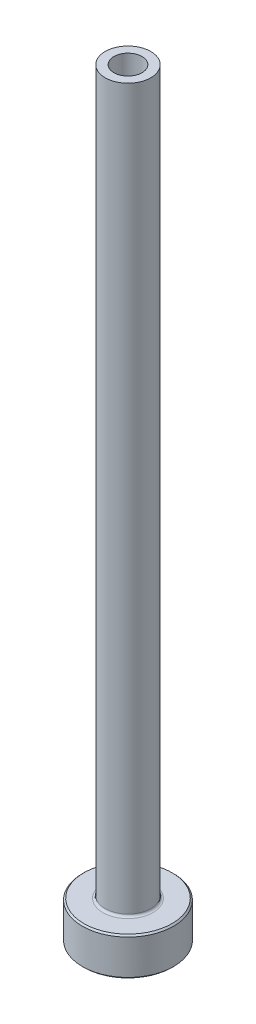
ISO-10303-21;
HEADER;
FILE_DESCRIPTION(('STEP AP214'),'2;1');
FILE_NAME('part.step','',(''),(''),'','','');
FILE_SCHEMA(('AUTOMOTIVE_DESIGN { 1 0 10303 214 1 1 1 1 }'));
ENDSEC;
DATA;
#1=APPLICATION_CONTEXT('core data for automotive mechanical design processes');
#2=APPLICATION_PROTOCOL_DEFINITION('international standard','automotive_design',2000,#1);
#3=PRODUCT_CONTEXT('',#1,'mechanical');
#4=PRODUCT('Part','Part','',(#3));
#5=PRODUCT_RELATED_PRODUCT_CATEGORY('part','',(#4));
#6=PRODUCT_DEFINITION_FORMATION('','',#4);
#7=PRODUCT_DEFINITION_CONTEXT('part definition',#1,'design');
#8=PRODUCT_DEFINITION('design','',#6,#7);
#9=PRODUCT_DEFINITION_SHAPE('','',#8);
#10=(LENGTH_UNIT() NAMED_UNIT(*) SI_UNIT(.MILLI.,.METRE.));
#11=(NAMED_UNIT(*) PLANE_ANGLE_UNIT() SI_UNIT($,.RADIAN.));
#12=(NAMED_UNIT(*) SI_UNIT($,.STERADIAN.) SOLID_ANGLE_UNIT());
#13=UNCERTAINTY_MEASURE_WITH_UNIT(LENGTH_MEASURE(1.E-05),#10,'distance_accuracy_value','');
#14=(GEOMETRIC_REPRESENTATION_CONTEXT(3) GLOBAL_UNCERTAINTY_ASSIGNED_CONTEXT((#13)) GLOBAL_UNIT_ASSIGNED_CONTEXT((#10,
#11,#12)) REPRESENTATION_CONTEXT('',''));
#15=CARTESIAN_POINT('',(0.,0.,0.));
#16=DIRECTION('',(0.,0.,1.));
#17=DIRECTION('',(1.,0.,0.));
#18=AXIS2_PLACEMENT_3D('',#15,#16,#17);
#19=CARTESIAN_POINT('',(0.,92.1876809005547,0.));
#20=DIRECTION('',(0.,1.,0.));
#21=DIRECTION('',(0.,0.,1.));
#22=AXIS2_PLACEMENT_3D('',#19,#20,#21);
#23=CYLINDRICAL_SURFACE('',#22,1.84999999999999);
#24=CARTESIAN_POINT('',(0.,100.,0.));
#25=DIRECTION('',(0.,1.,0.));
#26=DIRECTION('',(0.,0.,1.));
#27=AXIS2_PLACEMENT_3D('',#24,#25,#26);
#28=CIRCLE('',#27,1.84999999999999);
#29=CARTESIAN_POINT('',(0.,100.,1.84999999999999));
#30=VERTEX_POINT('',#29);
#31=EDGE_CURVE('E62',#30,#30,#28,.T.);
#32=ORIENTED_EDGE('',*,*,#31,.T.);
#33=EDGE_LOOP('',(#32));
#34=FACE_BOUND('',#33,.T.);
#35=CARTESIAN_POINT('',(0.,55.,0.));
#36=DIRECTION('',(0.,1.,0.));
#37=DIRECTION('',(0.,0.,1.));
#38=AXIS2_PLACEMENT_3D('',#35,#36,#37);
#39=CIRCLE('',#38,1.84999999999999);
#40=CARTESIAN_POINT('',(0.,55.,1.84999999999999));
#41=VERTEX_POINT('',#40);
#42=EDGE_CURVE('E71',#41,#41,#39,.T.);
#43=ORIENTED_EDGE('',*,*,#42,.F.);
#44=EDGE_LOOP('',(#43));
#45=FACE_BOUND('',#44,.T.);
#46=ADVANCED_FACE('F30',(#34,#45),#23,.F.);
#47=CARTESIAN_POINT('',(-1.84999999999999,100.,0.));
#48=DIRECTION('',(0.,1.,0.));
#49=DIRECTION('',(0.,0.,1.));
#50=AXIS2_PLACEMENT_3D('',#47,#48,#49);
#51=PLANE('',#50);
#52=CARTESIAN_POINT('',(0.,100.,0.));
#53=DIRECTION('',(0.,1.,0.));
#54=DIRECTION('',(0.,0.,1.));
#55=AXIS2_PLACEMENT_3D('',#52,#53,#54);
#56=CIRCLE('',#55,3.);
#57=CARTESIAN_POINT('',(0.,100.,3.));
#58=VERTEX_POINT('',#57);
#59=EDGE_CURVE('E65',#58,#58,#56,.T.);
#60=ORIENTED_EDGE('',*,*,#59,.T.);
#61=EDGE_LOOP('',(#60));
#62=FACE_BOUND('',#61,.T.);
#63=ORIENTED_EDGE('',*,*,#31,.F.);
#64=EDGE_LOOP('',(#63));
#65=FACE_BOUND('',#64,.T.);
#66=ADVANCED_FACE('F79',(#62,#65),#51,.T.);
#67=CARTESIAN_POINT('',(0.,92.1876809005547,0.));
#68=DIRECTION('',(0.,1.,0.));
#69=DIRECTION('',(0.,0.,1.));
#70=AXIS2_PLACEMENT_3D('',#67,#68,#69);
#71=CYLINDRICAL_SURFACE('',#70,2.99999999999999);
#72=CARTESIAN_POINT('',(0.,5.3,0.));
#73=DIRECTION('',(0.,1.,0.));
#74=DIRECTION('',(0.,0.,1.));
#75=AXIS2_PLACEMENT_3D('',#72,#73,#74);
#76=CIRCLE('',#75,2.99999999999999);
#77=CARTESIAN_POINT('',(0.,5.3,2.99999999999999));
#78=VERTEX_POINT('',#77);
#79=EDGE_CURVE('E59',#78,#78,#76,.T.);
#80=ORIENTED_EDGE('',*,*,#79,.T.);
#81=EDGE_LOOP('',(#80));
#82=FACE_BOUND('',#81,.T.);
#83=ORIENTED_EDGE('',*,*,#59,.F.);
#84=EDGE_LOOP('',(#83));
#85=FACE_BOUND('',#84,.T.);
#86=ADVANCED_FACE('F85',(#82,#85),#71,.T.);
#87=CARTESIAN_POINT('',(-2.99999999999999,5.,0.));
#88=DIRECTION('',(0.,1.,0.));
#89=DIRECTION('',(0.,0.,1.));
#90=AXIS2_PLACEMENT_3D('',#87,#88,#89);
#91=PLANE('',#90);
#92=CARTESIAN_POINT('',(0.,5.,0.));
#93=DIRECTION('',(0.,1.,0.));
#94=DIRECTION('',(0.,0.,1.));
#95=AXIS2_PLACEMENT_3D('',#92,#93,#94);
#96=CIRCLE('',#95,5.79999999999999);
#97=CARTESIAN_POINT('',(0.,5.,5.79999999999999));
#98=VERTEX_POINT('',#97);
#99=EDGE_CURVE('E53',#98,#98,#96,.T.);
#100=ORIENTED_EDGE('',*,*,#99,.T.);
#101=EDGE_LOOP('',(#100));
#102=FACE_BOUND('',#101,.T.);
#103=CARTESIAN_POINT('',(0.,5.,0.));
#104=DIRECTION('',(0.,1.,0.));
#105=DIRECTION('',(0.,0.,1.));
#106=AXIS2_PLACEMENT_3D('',#103,#104,#105);
#107=CIRCLE('',#106,3.29999999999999);
#108=CARTESIAN_POINT('',(0.,5.,3.29999999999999));
#109=VERTEX_POINT('',#108);
#110=EDGE_CURVE('E56',#109,#109,#107,.F.);
#111=ORIENTED_EDGE('',*,*,#110,.T.);
#112=EDGE_LOOP('',(#111));
#113=FACE_BOUND('',#112,.T.);
#114=ADVANCED_FACE('F111',(#102,#113),#91,.T.);
#115=CARTESIAN_POINT('',(0.,92.1876809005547,0.));
#116=DIRECTION('',(0.,1.,0.));
#117=DIRECTION('',(0.,0.,1.));
#118=AXIS2_PLACEMENT_3D('',#115,#116,#117);
#119=CYLINDRICAL_SURFACE('',#118,5.99999999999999);
#120=CARTESIAN_POINT('',(0.,4.79999999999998,0.));
#121=DIRECTION('',(0.,1.,0.));
#122=DIRECTION('',(0.,0.,1.));
#123=AXIS2_PLACEMENT_3D('',#120,#121,#122);
#124=CIRCLE('',#123,5.99999999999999);
#125=CARTESIAN_POINT('',(0.,4.79999999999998,5.99999999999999));
#126=VERTEX_POINT('',#125);
#127=EDGE_CURVE('E45',#126,#126,#124,.F.);
#128=ORIENTED_EDGE('',*,*,#127,.T.);
#129=EDGE_LOOP('',(#128));
#130=FACE_BOUND('',#129,.T.);
#131=CARTESIAN_POINT('',(0.,0.200000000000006,0.));
#132=DIRECTION('',(0.,-1.,0.));
#133=DIRECTION('',(0.,0.,-1.));
#134=AXIS2_PLACEMENT_3D('',#131,#132,#133);
#135=CIRCLE('',#134,5.99999999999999);
#136=CARTESIAN_POINT('',(0.,0.200000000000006,-5.99999999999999));
#137=VERTEX_POINT('',#136);
#138=EDGE_CURVE('E50',#137,#137,#135,.F.);
#139=ORIENTED_EDGE('',*,*,#138,.T.);
#140=EDGE_LOOP('',(#139));
#141=FACE_BOUND('',#140,.T.);
#142=ADVANCED_FACE('F108',(#130,#141),#119,.T.);
#143=CARTESIAN_POINT('',(-5.99999999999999,0.,0.));
#144=DIRECTION('',(0.,-1.,0.));
#145=DIRECTION('',(0.,0.,-1.));
#146=AXIS2_PLACEMENT_3D('',#143,#144,#145);
#147=PLANE('',#146);
#148=CARTESIAN_POINT('',(0.,0.,0.));
#149=DIRECTION('',(0.,-1.,0.));
#150=DIRECTION('',(0.,0.,-1.));
#151=AXIS2_PLACEMENT_3D('',#148,#149,#150);
#152=CIRCLE('',#151,2.59999999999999);
#153=CARTESIAN_POINT('',(0.,0.,-2.59999999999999));
#154=VERTEX_POINT('',#153);
#155=EDGE_CURVE('E37',#154,#154,#152,.F.);
#156=ORIENTED_EDGE('',*,*,#155,.T.);
#157=EDGE_LOOP('',(#156));
#158=FACE_BOUND('',#157,.T.);
#159=CARTESIAN_POINT('',(0.,0.,0.));
#160=DIRECTION('',(0.,-1.,0.));
#161=DIRECTION('',(0.,0.,-1.));
#162=AXIS2_PLACEMENT_3D('',#159,#160,#161);
#163=CIRCLE('',#162,5.79999999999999);
#164=CARTESIAN_POINT('',(0.,0.,-5.79999999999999));
#165=VERTEX_POINT('',#164);
#166=EDGE_CURVE('E41',#165,#165,#163,.T.);
#167=ORIENTED_EDGE('',*,*,#166,.T.);
#168=EDGE_LOOP('',(#167));
#169=FACE_BOUND('',#168,.T.);
#170=ADVANCED_FACE('F110',(#158,#169),#147,.T.);
#171=CARTESIAN_POINT('',(0.,92.1876809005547,0.));
#172=DIRECTION('',(0.,1.,0.));
#173=DIRECTION('',(0.,0.,1.));
#174=AXIS2_PLACEMENT_3D('',#171,#172,#173);
#175=CYLINDRICAL_SURFACE('',#174,2.09999999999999);
#176=CARTESIAN_POINT('',(0.,0.499999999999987,0.));
#177=DIRECTION('',(0.,-1.,0.));
#178=DIRECTION('',(0.,0.,-1.));
#179=AXIS2_PLACEMENT_3D('',#176,#177,#178);
#180=CIRCLE('',#179,2.09999999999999);
#181=CARTESIAN_POINT('',(0.,0.499999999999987,-2.09999999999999));
#182=VERTEX_POINT('',#181);
#183=EDGE_CURVE('E10',#182,#182,#180,.T.);
#184=ORIENTED_EDGE('',*,*,#183,.T.);
#185=EDGE_LOOP('',(#184));
#186=FACE_BOUND('',#185,.T.);
#187=CARTESIAN_POINT('',(0.,43.,0.));
#188=DIRECTION('',(0.,1.,0.));
#189=DIRECTION('',(0.,0.,1.));
#190=AXIS2_PLACEMENT_3D('',#187,#188,#189);
#191=CIRCLE('',#190,2.1);
#192=CARTESIAN_POINT('',(0.,43.,2.1));
#193=VERTEX_POINT('',#192);
#194=EDGE_CURVE('E68',#193,#193,#191,.T.);
#195=ORIENTED_EDGE('',*,*,#194,.T.);
#196=EDGE_LOOP('',(#195));
#197=FACE_BOUND('',#196,.T.);
#198=ADVANCED_FACE('F118',(#186,#197),#175,.F.);
#199=CARTESIAN_POINT('',(0.,43.,0.));
#200=DIRECTION('',(0.,-1.,0.));
#201=DIRECTION('',(0.,0.,-1.));
#202=AXIS2_PLACEMENT_3D('',#199,#200,#201);
#203=CONICAL_SURFACE('',#202,2.1,0.0208303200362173);
#204=ORIENTED_EDGE('',*,*,#42,.T.);
#205=EDGE_LOOP('',(#204));
#206=FACE_BOUND('',#205,.T.);
#207=ORIENTED_EDGE('',*,*,#194,.F.);
#208=EDGE_LOOP('',(#207));
#209=FACE_BOUND('',#208,.T.);
#210=ADVANCED_FACE('F75',(#206,#209),#203,.F.);
#211=CARTESIAN_POINT('',(0.,5.3,0.));
#212=DIRECTION('',(0.,1.,0.));
#213=DIRECTION('',(0.,0.,1.));
#214=AXIS2_PLACEMENT_3D('',#211,#212,#213);
#215=TOROIDAL_SURFACE('',#214,3.29999999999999,0.3);
#216=ORIENTED_EDGE('',*,*,#110,.F.);
#217=EDGE_LOOP('',(#216));
#218=FACE_BOUND('',#217,.T.);
#219=ORIENTED_EDGE('',*,*,#79,.F.);
#220=EDGE_LOOP('',(#219));
#221=FACE_BOUND('',#220,.T.);
#222=ADVANCED_FACE('F90',(#218,#221),#215,.F.);
#223=CARTESIAN_POINT('',(0.,5.,0.));
#224=DIRECTION('',(0.,-1.,0.));
#225=DIRECTION('',(0.,0.,-1.));
#226=AXIS2_PLACEMENT_3D('',#223,#224,#225);
#227=CONICAL_SURFACE('',#226,5.79999999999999,0.785398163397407);
#228=ORIENTED_EDGE('',*,*,#127,.F.);
#229=EDGE_LOOP('',(#228));
#230=FACE_BOUND('',#229,.T.);
#231=ORIENTED_EDGE('',*,*,#99,.F.);
#232=EDGE_LOOP('',(#231));
#233=FACE_BOUND('',#232,.T.);
#234=ADVANCED_FACE('F93',(#230,#233),#227,.T.);
#235=CARTESIAN_POINT('',(0.,0.200000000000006,0.));
#236=DIRECTION('',(0.,1.,0.));
#237=DIRECTION('',(0.,0.,1.));
#238=AXIS2_PLACEMENT_3D('',#235,#236,#237);
#239=CONICAL_SURFACE('',#238,5.99999999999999,0.78539816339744);
#240=ORIENTED_EDGE('',*,*,#166,.F.);
#241=EDGE_LOOP('',(#240));
#242=FACE_BOUND('',#241,.T.);
#243=ORIENTED_EDGE('',*,*,#138,.F.);
#244=EDGE_LOOP('',(#243));
#245=FACE_BOUND('',#244,.T.);
#246=ADVANCED_FACE('F96',(#242,#245),#239,.T.);
#247=CARTESIAN_POINT('',(0.,0.,0.));
#248=DIRECTION('',(0.,-1.,0.));
#249=DIRECTION('',(0.,0.,-1.));
#250=AXIS2_PLACEMENT_3D('',#247,#248,#249);
#251=CONICAL_SURFACE('',#250,2.59999999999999,0.78539816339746);
#252=ORIENTED_EDGE('',*,*,#183,.F.);
#253=EDGE_LOOP('',(#252));
#254=FACE_BOUND('',#253,.T.);
#255=ORIENTED_EDGE('',*,*,#155,.F.);
#256=EDGE_LOOP('',(#255));
#257=FACE_BOUND('',#256,.T.);
#258=ADVANCED_FACE('F32',(#254,#257),#251,.F.);
#259=CLOSED_SHELL('',(#46,#66,#86,#114,#142,#170,#198,#210,#222,#234,#246,#258));
#260=MANIFOLD_SOLID_BREP('B2',#259);
#261=ADVANCED_BREP_SHAPE_REPRESENTATION('',(#18,#260),#14);
#262=SHAPE_DEFINITION_REPRESENTATION(#9,#261);
ENDSEC;
END-ISO-10303-21;
